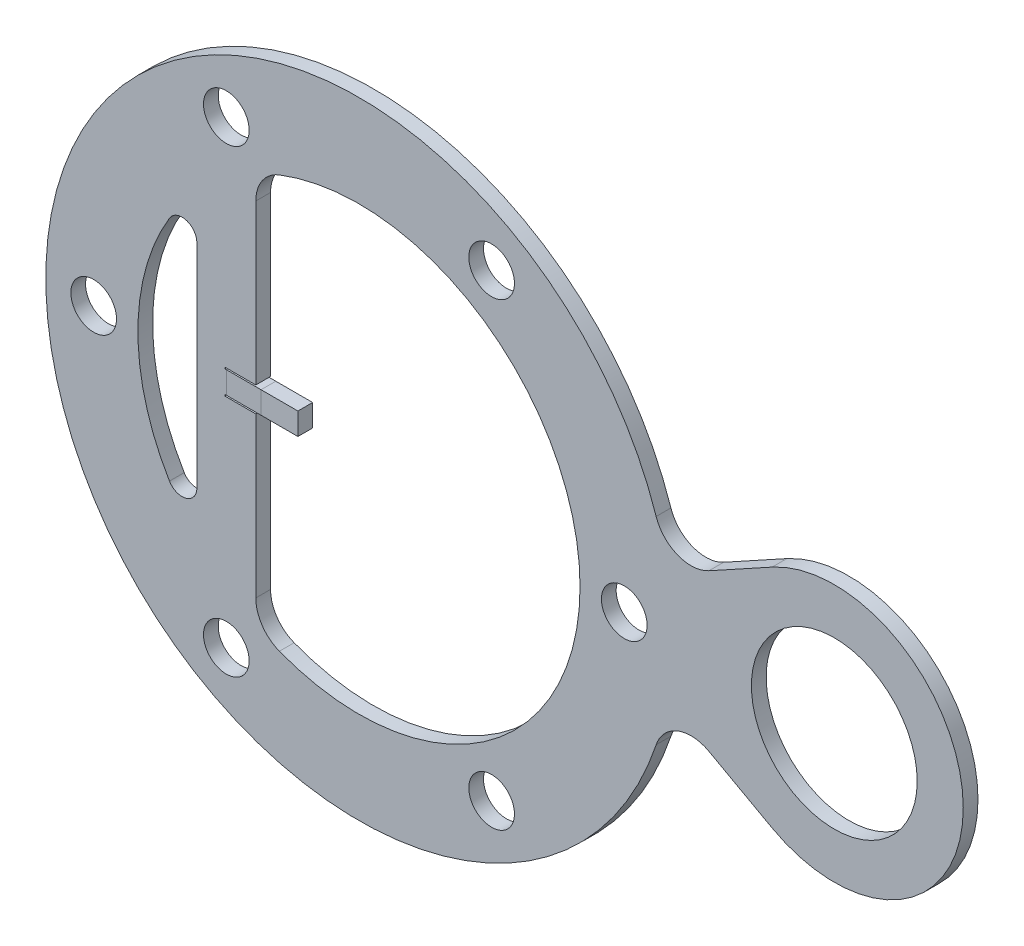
ISO-10303-21;
HEADER;
FILE_DESCRIPTION(('STEP AP214'),'2;1');
FILE_NAME('part.step','',(''),(''),'','','');
FILE_SCHEMA(('AUTOMOTIVE_DESIGN { 1 0 10303 214 1 1 1 1 }'));
ENDSEC;
DATA;
#1=APPLICATION_CONTEXT('core data for automotive mechanical design processes');
#2=APPLICATION_PROTOCOL_DEFINITION('international standard','automotive_design',2000,#1);
#3=PRODUCT_CONTEXT('',#1,'mechanical');
#4=PRODUCT('Part','Part','',(#3));
#5=PRODUCT_RELATED_PRODUCT_CATEGORY('part','',(#4));
#6=PRODUCT_DEFINITION_FORMATION('','',#4);
#7=PRODUCT_DEFINITION_CONTEXT('part definition',#1,'design');
#8=PRODUCT_DEFINITION('design','',#6,#7);
#9=PRODUCT_DEFINITION_SHAPE('','',#8);
#10=(LENGTH_UNIT() NAMED_UNIT(*) SI_UNIT(.MILLI.,.METRE.));
#11=(NAMED_UNIT(*) PLANE_ANGLE_UNIT() SI_UNIT($,.RADIAN.));
#12=(NAMED_UNIT(*) SI_UNIT($,.STERADIAN.) SOLID_ANGLE_UNIT());
#13=UNCERTAINTY_MEASURE_WITH_UNIT(LENGTH_MEASURE(1.E-05),#10,'distance_accuracy_value','');
#14=(GEOMETRIC_REPRESENTATION_CONTEXT(3) GLOBAL_UNCERTAINTY_ASSIGNED_CONTEXT((#13)) GLOBAL_UNIT_ASSIGNED_CONTEXT((#10,
#11,#12)) REPRESENTATION_CONTEXT('',''));
#15=CARTESIAN_POINT('',(0.,0.,0.));
#16=DIRECTION('',(0.,0.,1.));
#17=DIRECTION('',(1.,0.,0.));
#18=AXIS2_PLACEMENT_3D('',#15,#16,#17);
#19=CARTESIAN_POINT('',(0.,0.,0.));
#20=DIRECTION('',(0.,0.,1.));
#21=DIRECTION('',(1.,0.,0.));
#22=AXIS2_PLACEMENT_3D('',#19,#20,#21);
#23=PLANE('',#22);
#24=CARTESIAN_POINT('',(-88.5000000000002,14.4222051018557,0.));
#25=DIRECTION('',(0.,0.,1.));
#26=DIRECTION('',(1.,0.,0.));
#27=AXIS2_PLACEMENT_3D('',#24,#25,#26);
#28=CIRCLE('',#27,2.);
#29=CARTESIAN_POINT('',(-86.5000000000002,14.4222051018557,0.));
#30=VERTEX_POINT('',#29);
#31=CARTESIAN_POINT('',(-90.2142857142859,15.4523626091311,0.));
#32=VERTEX_POINT('',#31);
#33=EDGE_CURVE('E283',#30,#32,#28,.T.);
#34=ORIENTED_EDGE('',*,*,#33,.T.);
#35=CARTESIAN_POINT('',(-64.5,0.,0.));
#36=DIRECTION('',(0.,0.,1.));
#37=DIRECTION('',(1.,0.,0.));
#38=AXIS2_PLACEMENT_3D('',#35,#36,#37);
#39=CIRCLE('',#38,30.);
#40=CARTESIAN_POINT('',(-90.2142857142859,-15.4523626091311,0.));
#41=VERTEX_POINT('',#40);
#42=EDGE_CURVE('E285',#32,#41,#39,.T.);
#43=ORIENTED_EDGE('',*,*,#42,.T.);
#44=CARTESIAN_POINT('',(-88.5000000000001,-14.4222051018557,0.));
#45=DIRECTION('',(0.,0.,-1.));
#46=DIRECTION('',(-1.,0.,0.));
#47=AXIS2_PLACEMENT_3D('',#44,#45,#46);
#48=CIRCLE('',#47,2.);
#49=CARTESIAN_POINT('',(-86.5000000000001,-14.4222051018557,0.));
#50=VERTEX_POINT('',#49);
#51=EDGE_CURVE('E287',#50,#41,#48,.T.);
#52=ORIENTED_EDGE('',*,*,#51,.F.);
#53=DIRECTION('',(0.,-1.,0.));
#54=VECTOR('',#53,1.);
#55=CARTESIAN_POINT('',(-86.5000000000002,14.4222051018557,0.));
#56=LINE('',#55,#54);
#57=EDGE_CURVE('E290',#30,#50,#56,.T.);
#58=ORIENTED_EDGE('',*,*,#57,.F.);
#59=EDGE_LOOP('',(#34,#43,#52,#58));
#60=FACE_BOUND('',#59,.T.);
#61=CARTESIAN_POINT('',(-82.5000000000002,31.1769145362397,0.));
#62=DIRECTION('',(0.,0.,1.));
#63=DIRECTION('',(1.,0.,0.));
#64=AXIS2_PLACEMENT_3D('',#61,#62,#63);
#65=CIRCLE('',#64,3.1);
#66=CARTESIAN_POINT('',(-79.4000000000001,31.1769145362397,0.));
#67=VERTEX_POINT('',#66);
#68=EDGE_CURVE('E280',#67,#67,#65,.T.);
#69=ORIENTED_EDGE('',*,*,#68,.T.);
#70=EDGE_LOOP('',(#69));
#71=FACE_BOUND('',#70,.T.);
#72=CARTESIAN_POINT('',(-28.5,0.,0.));
#73=DIRECTION('',(0.,0.,1.));
#74=DIRECTION('',(1.,0.,0.));
#75=AXIS2_PLACEMENT_3D('',#72,#73,#74);
#76=CIRCLE('',#75,3.1);
#77=CARTESIAN_POINT('',(-25.4,0.,0.));
#78=VERTEX_POINT('',#77);
#79=EDGE_CURVE('E277',#78,#78,#76,.T.);
#80=ORIENTED_EDGE('',*,*,#79,.T.);
#81=EDGE_LOOP('',(#80));
#82=FACE_BOUND('',#81,.T.);
#83=CARTESIAN_POINT('',(0.,0.,0.));
#84=DIRECTION('',(0.,0.,1.));
#85=DIRECTION('',(1.,0.,0.));
#86=AXIS2_PLACEMENT_3D('',#83,#84,#85);
#87=CIRCLE('',#86,17.5);
#88=CARTESIAN_POINT('',(-8.43804173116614,-15.3313225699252,1.11022302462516E-13));
#89=VERTEX_POINT('',#88);
#90=CARTESIAN_POINT('',(-8.43804173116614,15.3313225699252,0.));
#91=VERTEX_POINT('',#90);
#92=EDGE_CURVE('E260',#89,#91,#87,.T.);
#93=ORIENTED_EDGE('',*,*,#92,.F.);
#94=DIRECTION('',(0.876075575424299,-0.482173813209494,0.));
#95=VECTOR('',#94,1.);
#96=CARTESIAN_POINT('',(-17.016509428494,-10.6099120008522,0.));
#97=LINE('',#96,#95);
#98=CARTESIAN_POINT('',(-17.016509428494,-10.6099120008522,0.));
#99=VERTEX_POINT('',#98);
#100=EDGE_CURVE('E263',#99,#89,#97,.T.);
#101=ORIENTED_EDGE('',*,*,#100,.F.);
#102=CARTESIAN_POINT('',(-19.4273784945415,-14.9902898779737,0.));
#103=DIRECTION('',(0.,0.,-1.));
#104=DIRECTION('',(-1.,0.,0.));
#105=AXIS2_PLACEMENT_3D('',#102,#103,#104);
#106=CIRCLE('',#105,5.);
#107=CARTESIAN_POINT('',(-24.1718649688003,-13.4123646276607,0.));
#108=VERTEX_POINT('',#107);
#109=EDGE_CURVE('E266',#108,#99,#106,.T.);
#110=ORIENTED_EDGE('',*,*,#109,.F.);
#111=CARTESIAN_POINT('',(-64.5,0.,0.));
#112=DIRECTION('',(0.,0.,1.));
#113=DIRECTION('',(1.,0.,0.));
#114=AXIS2_PLACEMENT_3D('',#111,#112,#113);
#115=CIRCLE('',#114,42.5);
#116=CARTESIAN_POINT('',(-24.1718649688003,13.4123646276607,0.));
#117=VERTEX_POINT('',#116);
#118=EDGE_CURVE('E269',#117,#108,#115,.T.);
#119=ORIENTED_EDGE('',*,*,#118,.F.);
#120=CARTESIAN_POINT('',(-19.4273784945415,14.9902898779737,0.));
#121=DIRECTION('',(0.,0.,-1.));
#122=DIRECTION('',(-1.,0.,0.));
#123=AXIS2_PLACEMENT_3D('',#120,#121,#122);
#124=CIRCLE('',#123,5.);
#125=CARTESIAN_POINT('',(-17.016509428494,10.6099120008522,0.));
#126=VERTEX_POINT('',#125);
#127=EDGE_CURVE('E272',#126,#117,#124,.T.);
#128=ORIENTED_EDGE('',*,*,#127,.F.);
#129=DIRECTION('',(0.876075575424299,0.482173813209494,0.));
#130=VECTOR('',#129,1.);
#131=CARTESIAN_POINT('',(-17.016509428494,10.6099120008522,0.));
#132=LINE('',#131,#130);
#133=EDGE_CURVE('E275',#126,#91,#132,.T.);
#134=ORIENTED_EDGE('',*,*,#133,.T.);
#135=EDGE_LOOP('',(#93,#101,#110,#119,#128,#134));
#136=FACE_BOUND('',#135,.T.);
#137=CARTESIAN_POINT('',(0.,0.,0.));
#138=DIRECTION('',(0.,0.,1.));
#139=DIRECTION('',(1.,0.,0.));
#140=AXIS2_PLACEMENT_3D('',#137,#138,#139);
#141=CIRCLE('',#140,11.25);
#142=CARTESIAN_POINT('',(11.25,0.,0.));
#143=VERTEX_POINT('',#142);
#144=EDGE_CURVE('E257',#143,#143,#141,.T.);
#145=ORIENTED_EDGE('',*,*,#144,.T.);
#146=EDGE_LOOP('',(#145));
#147=FACE_BOUND('',#146,.T.);
#148=CARTESIAN_POINT('',(-82.5000000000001,-31.1769145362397,0.));
#149=DIRECTION('',(0.,0.,1.));
#150=DIRECTION('',(1.,0.,0.));
#151=AXIS2_PLACEMENT_3D('',#148,#149,#150);
#152=CIRCLE('',#151,3.1);
#153=CARTESIAN_POINT('',(-79.4000000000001,-31.1769145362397,0.));
#154=VERTEX_POINT('',#153);
#155=EDGE_CURVE('E254',#154,#154,#152,.T.);
#156=ORIENTED_EDGE('',*,*,#155,.T.);
#157=EDGE_LOOP('',(#156));
#158=FACE_BOUND('',#157,.T.);
#159=CARTESIAN_POINT('',(-46.4999999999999,-31.1769145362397,0.));
#160=DIRECTION('',(0.,0.,-1.));
#161=DIRECTION('',(-1.,0.,0.));
#162=AXIS2_PLACEMENT_3D('',#159,#160,#161);
#163=CIRCLE('',#162,3.1);
#164=CARTESIAN_POINT('',(-49.5999999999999,-31.1769145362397,0.));
#165=VERTEX_POINT('',#164);
#166=EDGE_CURVE('E251',#165,#165,#163,.T.);
#167=ORIENTED_EDGE('',*,*,#166,.F.);
#168=EDGE_LOOP('',(#167));
#169=FACE_BOUND('',#168,.T.);
#170=CARTESIAN_POINT('',(-46.4999999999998,31.1769145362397,0.));
#171=DIRECTION('',(0.,0.,-1.));
#172=DIRECTION('',(-1.,0.,0.));
#173=AXIS2_PLACEMENT_3D('',#170,#171,#172);
#174=CIRCLE('',#173,3.1);
#175=CARTESIAN_POINT('',(-49.5999999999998,31.1769145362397,0.));
#176=VERTEX_POINT('',#175);
#177=EDGE_CURVE('E243',#176,#176,#174,.T.);
#178=ORIENTED_EDGE('',*,*,#177,.F.);
#179=EDGE_LOOP('',(#178));
#180=FACE_BOUND('',#179,.T.);
#181=CARTESIAN_POINT('',(-100.5,0.,0.));
#182=DIRECTION('',(0.,0.,-1.));
#183=DIRECTION('',(-1.,0.,0.));
#184=AXIS2_PLACEMENT_3D('',#181,#182,#183);
#185=CIRCLE('',#184,3.1);
#186=CARTESIAN_POINT('',(-103.6,0.,0.));
#187=VERTEX_POINT('',#186);
#188=EDGE_CURVE('E240',#187,#187,#185,.T.);
#189=ORIENTED_EDGE('',*,*,#188,.F.);
#190=EDGE_LOOP('',(#189));
#191=FACE_BOUND('',#190,.T.);
#192=DIRECTION('',(0.,1.,0.));
#193=VECTOR('',#192,1.);
#194=CARTESIAN_POINT('',(-82.5000000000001,-1.5,0.));
#195=LINE('',#194,#193);
#196=CARTESIAN_POINT('',(-82.5000000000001,-1.5,0.));
#197=VERTEX_POINT('',#196);
#198=CARTESIAN_POINT('',(-82.5000000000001,1.5,0.));
#199=VERTEX_POINT('',#198);
#200=EDGE_CURVE('E217',#197,#199,#195,.T.);
#201=ORIENTED_EDGE('',*,*,#200,.F.);
#202=DIRECTION('',(1.,0.,0.));
#203=VECTOR('',#202,1.);
#204=CARTESIAN_POINT('',(0.,-1.50000000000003,0.));
#205=LINE('',#204,#203);
#206=CARTESIAN_POINT('',(-82.7000000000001,-1.5,1.11022302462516E-13));
#207=VERTEX_POINT('',#206);
#208=EDGE_CURVE('E236',#207,#197,#205,.T.);
#209=ORIENTED_EDGE('',*,*,#208,.F.);
#210=DIRECTION('',(0.,1.,0.));
#211=VECTOR('',#210,1.);
#212=CARTESIAN_POINT('',(-82.7000000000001,0.,0.));
#213=LINE('',#212,#211);
#214=CARTESIAN_POINT('',(-82.7000000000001,-1.7,0.));
#215=VERTEX_POINT('',#214);
#216=EDGE_CURVE('E302',#215,#207,#213,.T.);
#217=ORIENTED_EDGE('',*,*,#216,.F.);
#218=DIRECTION('',(-1.,0.,0.));
#219=VECTOR('',#218,1.);
#220=CARTESIAN_POINT('',(0.,-1.70000000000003,0.));
#221=LINE('',#220,#219);
#222=CARTESIAN_POINT('',(-78.5000000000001,-1.7,0.));
#223=VERTEX_POINT('',#222);
#224=EDGE_CURVE('E305',#223,#215,#221,.T.);
#225=ORIENTED_EDGE('',*,*,#224,.F.);
#226=DIRECTION('',(0.,-1.,0.));
#227=VECTOR('',#226,1.);
#228=CARTESIAN_POINT('',(-78.5000000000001,23.3238075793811,0.));
#229=LINE('',#228,#227);
#230=CARTESIAN_POINT('',(-78.5000000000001,-23.3238075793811,0.));
#231=VERTEX_POINT('',#230);
#232=EDGE_CURVE('E300',#223,#231,#229,.T.);
#233=ORIENTED_EDGE('',*,*,#232,.T.);
#234=CARTESIAN_POINT('',(-73.5000000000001,-23.3238075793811,0.));
#235=DIRECTION('',(0.,0.,-1.));
#236=DIRECTION('',(-1.,0.,0.));
#237=AXIS2_PLACEMENT_3D('',#234,#235,#236);
#238=CIRCLE('',#237,5.00000000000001);
#239=CARTESIAN_POINT('',(-75.3000000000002,-27.9885690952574,0.));
#240=VERTEX_POINT('',#239);
#241=EDGE_CURVE('E308',#240,#231,#238,.T.);
#242=ORIENTED_EDGE('',*,*,#241,.F.);
#243=CARTESIAN_POINT('',(-64.5,0.,0.));
#244=DIRECTION('',(0.,0.,1.));
#245=DIRECTION('',(1.,0.,0.));
#246=AXIS2_PLACEMENT_3D('',#243,#244,#245);
#247=CIRCLE('',#246,30.);
#248=CARTESIAN_POINT('',(-75.3000000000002,27.9885690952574,0.));
#249=VERTEX_POINT('',#248);
#250=EDGE_CURVE('E311',#240,#249,#247,.T.);
#251=ORIENTED_EDGE('',*,*,#250,.T.);
#252=CARTESIAN_POINT('',(-73.5000000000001,23.3238075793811,0.));
#253=DIRECTION('',(0.,0.,1.));
#254=DIRECTION('',(1.,0.,0.));
#255=AXIS2_PLACEMENT_3D('',#252,#253,#254);
#256=CIRCLE('',#255,5.00000000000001);
#257=CARTESIAN_POINT('',(-78.5000000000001,23.3238075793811,0.));
#258=VERTEX_POINT('',#257);
#259=EDGE_CURVE('E299',#249,#258,#256,.T.);
#260=ORIENTED_EDGE('',*,*,#259,.T.);
#261=CARTESIAN_POINT('',(-78.5000000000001,1.7,0.));
#262=VERTEX_POINT('',#261);
#263=EDGE_CURVE('E296',#258,#262,#229,.T.);
#264=ORIENTED_EDGE('',*,*,#263,.T.);
#265=DIRECTION('',(1.,0.,0.));
#266=VECTOR('',#265,1.);
#267=CARTESIAN_POINT('',(0.,1.70000000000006,0.));
#268=LINE('',#267,#266);
#269=CARTESIAN_POINT('',(-82.7000000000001,1.7,0.));
#270=VERTEX_POINT('',#269);
#271=EDGE_CURVE('E298',#270,#262,#268,.T.);
#272=ORIENTED_EDGE('',*,*,#271,.F.);
#273=DIRECTION('',(0.,1.,0.));
#274=VECTOR('',#273,1.);
#275=CARTESIAN_POINT('',(-82.7000000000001,0.,0.));
#276=LINE('',#275,#274);
#277=CARTESIAN_POINT('',(-82.7000000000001,1.5,0.));
#278=VERTEX_POINT('',#277);
#279=EDGE_CURVE('E316',#278,#270,#276,.T.);
#280=ORIENTED_EDGE('',*,*,#279,.F.);
#281=DIRECTION('',(-1.,0.,0.));
#282=VECTOR('',#281,1.);
#283=CARTESIAN_POINT('',(0.,1.50000000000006,0.));
#284=LINE('',#283,#282);
#285=EDGE_CURVE('E293',#199,#278,#284,.T.);
#286=ORIENTED_EDGE('',*,*,#285,.F.);
#287=EDGE_LOOP('',(#201,#209,#217,#225,#233,#242,#251,#260,#264,#272,#280,#286));
#288=FACE_BOUND('',#287,.T.);
#289=ADVANCED_FACE('F28',(#60,#71,#82,#136,#147,#158,#169,#180,#191,#288),#23,.F.);
#290=CARTESIAN_POINT('',(0.,0.,2.));
#291=DIRECTION('',(0.,0.,1.));
#292=DIRECTION('',(1.,0.,0.));
#293=AXIS2_PLACEMENT_3D('',#290,#291,#292);
#294=PLANE('',#293);
#295=CARTESIAN_POINT('',(-64.5,0.,2.));
#296=DIRECTION('',(0.,0.,1.));
#297=DIRECTION('',(1.,0.,0.));
#298=AXIS2_PLACEMENT_3D('',#295,#296,#297);
#299=CIRCLE('',#298,30.);
#300=CARTESIAN_POINT('',(-90.2142857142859,15.4523626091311,2.));
#301=VERTEX_POINT('',#300);
#302=CARTESIAN_POINT('',(-90.2142857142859,-15.4523626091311,2.));
#303=VERTEX_POINT('',#302);
#304=EDGE_CURVE('E415',#301,#303,#299,.T.);
#305=ORIENTED_EDGE('',*,*,#304,.F.);
#306=CARTESIAN_POINT('',(-88.5000000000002,14.4222051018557,2.));
#307=DIRECTION('',(0.,0.,1.));
#308=DIRECTION('',(1.,0.,0.));
#309=AXIS2_PLACEMENT_3D('',#306,#307,#308);
#310=CIRCLE('',#309,2.);
#311=CARTESIAN_POINT('',(-86.5000000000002,14.4222051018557,2.));
#312=VERTEX_POINT('',#311);
#313=EDGE_CURVE('E417',#312,#301,#310,.T.);
#314=ORIENTED_EDGE('',*,*,#313,.F.);
#315=DIRECTION('',(0.,-1.,0.));
#316=VECTOR('',#315,1.);
#317=CARTESIAN_POINT('',(-86.5000000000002,14.4222051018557,2.));
#318=LINE('',#317,#316);
#319=CARTESIAN_POINT('',(-86.5000000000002,-14.4222051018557,2.));
#320=VERTEX_POINT('',#319);
#321=EDGE_CURVE('E420',#312,#320,#318,.T.);
#322=ORIENTED_EDGE('',*,*,#321,.T.);
#323=CARTESIAN_POINT('',(-88.5000000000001,-14.4222051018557,2.));
#324=DIRECTION('',(0.,0.,-1.));
#325=DIRECTION('',(-1.,0.,0.));
#326=AXIS2_PLACEMENT_3D('',#323,#324,#325);
#327=CIRCLE('',#326,2.);
#328=EDGE_CURVE('E422',#320,#303,#327,.T.);
#329=ORIENTED_EDGE('',*,*,#328,.T.);
#330=EDGE_LOOP('',(#305,#314,#322,#329));
#331=FACE_BOUND('',#330,.T.);
#332=CARTESIAN_POINT('',(-82.5000000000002,31.1769145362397,2.));
#333=DIRECTION('',(0.,0.,1.));
#334=DIRECTION('',(1.,0.,0.));
#335=AXIS2_PLACEMENT_3D('',#332,#333,#334);
#336=CIRCLE('',#335,3.1);
#337=CARTESIAN_POINT('',(-79.4000000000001,31.1769145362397,2.));
#338=VERTEX_POINT('',#337);
#339=EDGE_CURVE('E412',#338,#338,#336,.T.);
#340=ORIENTED_EDGE('',*,*,#339,.F.);
#341=EDGE_LOOP('',(#340));
#342=FACE_BOUND('',#341,.T.);
#343=CARTESIAN_POINT('',(-28.5,0.,2.));
#344=DIRECTION('',(0.,0.,1.));
#345=DIRECTION('',(1.,0.,0.));
#346=AXIS2_PLACEMENT_3D('',#343,#344,#345);
#347=CIRCLE('',#346,3.1);
#348=CARTESIAN_POINT('',(-25.4,0.,2.));
#349=VERTEX_POINT('',#348);
#350=EDGE_CURVE('E409',#349,#349,#347,.T.);
#351=ORIENTED_EDGE('',*,*,#350,.F.);
#352=EDGE_LOOP('',(#351));
#353=FACE_BOUND('',#352,.T.);
#354=CARTESIAN_POINT('',(0.,0.,2.));
#355=DIRECTION('',(0.,0.,1.));
#356=DIRECTION('',(1.,0.,0.));
#357=AXIS2_PLACEMENT_3D('',#354,#355,#356);
#358=CIRCLE('',#357,17.5);
#359=CARTESIAN_POINT('',(-8.43804173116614,-15.3313225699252,2.));
#360=VERTEX_POINT('',#359);
#361=CARTESIAN_POINT('',(-8.43804173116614,15.3313225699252,2.00000000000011));
#362=VERTEX_POINT('',#361);
#363=EDGE_CURVE('E386',#360,#362,#358,.T.);
#364=ORIENTED_EDGE('',*,*,#363,.T.);
#365=DIRECTION('',(0.876075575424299,0.482173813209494,0.));
#366=VECTOR('',#365,1.);
#367=CARTESIAN_POINT('',(-17.016509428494,10.6099120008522,2.));
#368=LINE('',#367,#366);
#369=CARTESIAN_POINT('',(-17.016509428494,10.6099120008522,2.00000000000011));
#370=VERTEX_POINT('',#369);
#371=EDGE_CURVE('E382',#370,#362,#368,.T.);
#372=ORIENTED_EDGE('',*,*,#371,.F.);
#373=CARTESIAN_POINT('',(-19.4273784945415,14.9902898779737,2.));
#374=DIRECTION('',(0.,0.,-1.));
#375=DIRECTION('',(-1.,0.,0.));
#376=AXIS2_PLACEMENT_3D('',#373,#374,#375);
#377=CIRCLE('',#376,5.);
#378=CARTESIAN_POINT('',(-24.1718649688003,13.4123646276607,2.00000000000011));
#379=VERTEX_POINT('',#378);
#380=EDGE_CURVE('E395',#370,#379,#377,.T.);
#381=ORIENTED_EDGE('',*,*,#380,.T.);
#382=CARTESIAN_POINT('',(-64.5,0.,2.));
#383=DIRECTION('',(0.,0.,1.));
#384=DIRECTION('',(1.,0.,0.));
#385=AXIS2_PLACEMENT_3D('',#382,#383,#384);
#386=CIRCLE('',#385,42.5);
#387=CARTESIAN_POINT('',(-24.1718649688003,-13.4123646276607,2.00000000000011));
#388=VERTEX_POINT('',#387);
#389=EDGE_CURVE('E403',#379,#388,#386,.T.);
#390=ORIENTED_EDGE('',*,*,#389,.T.);
#391=CARTESIAN_POINT('',(-19.4273784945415,-14.9902898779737,2.));
#392=DIRECTION('',(0.,0.,-1.));
#393=DIRECTION('',(-1.,0.,0.));
#394=AXIS2_PLACEMENT_3D('',#391,#392,#393);
#395=CIRCLE('',#394,5.);
#396=CARTESIAN_POINT('',(-17.016509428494,-10.6099120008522,2.00000000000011));
#397=VERTEX_POINT('',#396);
#398=EDGE_CURVE('E406',#388,#397,#395,.T.);
#399=ORIENTED_EDGE('',*,*,#398,.T.);
#400=DIRECTION('',(0.876075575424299,-0.482173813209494,0.));
#401=VECTOR('',#400,1.);
#402=CARTESIAN_POINT('',(-17.016509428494,-10.6099120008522,2.));
#403=LINE('',#402,#401);
#404=EDGE_CURVE('E392',#397,#360,#403,.T.);
#405=ORIENTED_EDGE('',*,*,#404,.T.);
#406=EDGE_LOOP('',(#364,#372,#381,#390,#399,#405));
#407=FACE_BOUND('',#406,.T.);
#408=CARTESIAN_POINT('',(0.,0.,2.));
#409=DIRECTION('',(0.,0.,1.));
#410=DIRECTION('',(1.,0.,0.));
#411=AXIS2_PLACEMENT_3D('',#408,#409,#410);
#412=CIRCLE('',#411,11.25);
#413=CARTESIAN_POINT('',(11.25,0.,2.));
#414=VERTEX_POINT('',#413);
#415=EDGE_CURVE('E393',#414,#414,#412,.T.);
#416=ORIENTED_EDGE('',*,*,#415,.F.);
#417=EDGE_LOOP('',(#416));
#418=FACE_BOUND('',#417,.T.);
#419=CARTESIAN_POINT('',(-82.5000000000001,-31.1769145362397,2.));
#420=DIRECTION('',(0.,0.,1.));
#421=DIRECTION('',(1.,0.,0.));
#422=AXIS2_PLACEMENT_3D('',#419,#420,#421);
#423=CIRCLE('',#422,3.1);
#424=CARTESIAN_POINT('',(-79.4000000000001,-31.1769145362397,2.));
#425=VERTEX_POINT('',#424);
#426=EDGE_CURVE('E398',#425,#425,#423,.T.);
#427=ORIENTED_EDGE('',*,*,#426,.F.);
#428=EDGE_LOOP('',(#427));
#429=FACE_BOUND('',#428,.T.);
#430=CARTESIAN_POINT('',(-46.4999999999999,-31.1769145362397,2.));
#431=DIRECTION('',(0.,0.,-1.));
#432=DIRECTION('',(-1.,0.,0.));
#433=AXIS2_PLACEMENT_3D('',#430,#431,#432);
#434=CIRCLE('',#433,3.1);
#435=CARTESIAN_POINT('',(-49.5999999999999,-31.1769145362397,2.));
#436=VERTEX_POINT('',#435);
#437=EDGE_CURVE('E697',#436,#436,#434,.T.);
#438=ORIENTED_EDGE('',*,*,#437,.T.);
#439=EDGE_LOOP('',(#438));
#440=FACE_BOUND('',#439,.T.);
#441=CARTESIAN_POINT('',(-46.4999999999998,31.1769145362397,2.));
#442=DIRECTION('',(0.,0.,-1.));
#443=DIRECTION('',(-1.,0.,0.));
#444=AXIS2_PLACEMENT_3D('',#441,#442,#443);
#445=CIRCLE('',#444,3.1);
#446=CARTESIAN_POINT('',(-49.5999999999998,31.1769145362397,2.));
#447=VERTEX_POINT('',#446);
#448=EDGE_CURVE('E694',#447,#447,#445,.T.);
#449=ORIENTED_EDGE('',*,*,#448,.T.);
#450=EDGE_LOOP('',(#449));
#451=FACE_BOUND('',#450,.T.);
#452=CARTESIAN_POINT('',(-100.5,0.,2.));
#453=DIRECTION('',(0.,0.,-1.));
#454=DIRECTION('',(-1.,0.,0.));
#455=AXIS2_PLACEMENT_3D('',#452,#453,#454);
#456=CIRCLE('',#455,3.1);
#457=CARTESIAN_POINT('',(-103.6,0.,2.));
#458=VERTEX_POINT('',#457);
#459=EDGE_CURVE('E691',#458,#458,#456,.T.);
#460=ORIENTED_EDGE('',*,*,#459,.T.);
#461=EDGE_LOOP('',(#460));
#462=FACE_BOUND('',#461,.T.);
#463=DIRECTION('',(1.,0.,0.));
#464=VECTOR('',#463,1.);
#465=CARTESIAN_POINT('',(0.,-1.50000000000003,2.));
#466=LINE('',#465,#464);
#467=CARTESIAN_POINT('',(-82.7000000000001,-1.5,2.));
#468=VERTEX_POINT('',#467);
#469=CARTESIAN_POINT('',(-82.5000000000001,-1.5,2.));
#470=VERTEX_POINT('',#469);
#471=EDGE_CURVE('E234',#468,#470,#466,.T.);
#472=ORIENTED_EDGE('',*,*,#471,.T.);
#473=DIRECTION('',(0.,1.,0.));
#474=VECTOR('',#473,1.);
#475=CARTESIAN_POINT('',(-82.5000000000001,-1.5,2.));
#476=LINE('',#475,#474);
#477=CARTESIAN_POINT('',(-82.5000000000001,1.5,2.));
#478=VERTEX_POINT('',#477);
#479=EDGE_CURVE('E206',#470,#478,#476,.T.);
#480=ORIENTED_EDGE('',*,*,#479,.T.);
#481=DIRECTION('',(-1.,0.,0.));
#482=VECTOR('',#481,1.);
#483=CARTESIAN_POINT('',(0.,1.50000000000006,2.));
#484=LINE('',#483,#482);
#485=CARTESIAN_POINT('',(-82.7000000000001,1.5,2.00000000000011));
#486=VERTEX_POINT('',#485);
#487=EDGE_CURVE('E425',#478,#486,#484,.T.);
#488=ORIENTED_EDGE('',*,*,#487,.T.);
#489=DIRECTION('',(0.,1.,0.));
#490=VECTOR('',#489,1.);
#491=CARTESIAN_POINT('',(-82.7000000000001,0.,2.));
#492=LINE('',#491,#490);
#493=CARTESIAN_POINT('',(-82.7000000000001,1.7,2.00000000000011));
#494=VERTEX_POINT('',#493);
#495=EDGE_CURVE('E45',#486,#494,#492,.T.);
#496=ORIENTED_EDGE('',*,*,#495,.T.);
#497=DIRECTION('',(1.,0.,0.));
#498=VECTOR('',#497,1.);
#499=CARTESIAN_POINT('',(0.,1.70000000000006,2.));
#500=LINE('',#499,#498);
#501=CARTESIAN_POINT('',(-78.5000000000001,1.7,2.00000000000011));
#502=VERTEX_POINT('',#501);
#503=EDGE_CURVE('E53',#494,#502,#500,.T.);
#504=ORIENTED_EDGE('',*,*,#503,.T.);
#505=DIRECTION('',(0.,-1.,0.));
#506=VECTOR('',#505,1.);
#507=CARTESIAN_POINT('',(-78.5000000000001,23.3238075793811,2.));
#508=LINE('',#507,#506);
#509=CARTESIAN_POINT('',(-78.5000000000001,23.3238075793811,2.00000000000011));
#510=VERTEX_POINT('',#509);
#511=EDGE_CURVE('E429',#510,#502,#508,.T.);
#512=ORIENTED_EDGE('',*,*,#511,.F.);
#513=CARTESIAN_POINT('',(-73.5000000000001,23.3238075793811,2.));
#514=DIRECTION('',(0.,0.,1.));
#515=DIRECTION('',(1.,0.,0.));
#516=AXIS2_PLACEMENT_3D('',#513,#514,#515);
#517=CIRCLE('',#516,5.00000000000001);
#518=CARTESIAN_POINT('',(-75.3000000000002,27.9885690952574,2.00000000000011));
#519=VERTEX_POINT('',#518);
#520=EDGE_CURVE('E431',#519,#510,#517,.T.);
#521=ORIENTED_EDGE('',*,*,#520,.F.);
#522=CARTESIAN_POINT('',(-64.5,0.,2.));
#523=DIRECTION('',(0.,0.,1.));
#524=DIRECTION('',(1.,0.,0.));
#525=AXIS2_PLACEMENT_3D('',#522,#523,#524);
#526=CIRCLE('',#525,30.);
#527=CARTESIAN_POINT('',(-75.3000000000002,-27.9885690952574,2.00000000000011));
#528=VERTEX_POINT('',#527);
#529=EDGE_CURVE('E458',#528,#519,#526,.T.);
#530=ORIENTED_EDGE('',*,*,#529,.F.);
#531=CARTESIAN_POINT('',(-73.5000000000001,-23.3238075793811,2.));
#532=DIRECTION('',(0.,0.,-1.));
#533=DIRECTION('',(-1.,0.,0.));
#534=AXIS2_PLACEMENT_3D('',#531,#532,#533);
#535=CIRCLE('',#534,5.00000000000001);
#536=CARTESIAN_POINT('',(-78.5000000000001,-23.3238075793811,2.00000000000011));
#537=VERTEX_POINT('',#536);
#538=EDGE_CURVE('E439',#528,#537,#535,.T.);
#539=ORIENTED_EDGE('',*,*,#538,.T.);
#540=CARTESIAN_POINT('',(-78.5000000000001,-1.7,2.00000000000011));
#541=VERTEX_POINT('',#540);
#542=EDGE_CURVE('E437',#541,#537,#508,.T.);
#543=ORIENTED_EDGE('',*,*,#542,.F.);
#544=DIRECTION('',(-1.,0.,0.));
#545=VECTOR('',#544,1.);
#546=CARTESIAN_POINT('',(0.,-1.70000000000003,2.));
#547=LINE('',#546,#545);
#548=CARTESIAN_POINT('',(-82.7000000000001,-1.7,2.00000000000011));
#549=VERTEX_POINT('',#548);
#550=EDGE_CURVE('E245',#541,#549,#547,.T.);
#551=ORIENTED_EDGE('',*,*,#550,.T.);
#552=DIRECTION('',(0.,1.,0.));
#553=VECTOR('',#552,1.);
#554=CARTESIAN_POINT('',(-82.7000000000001,0.,2.));
#555=LINE('',#554,#553);
#556=EDGE_CURVE('E239',#549,#468,#555,.T.);
#557=ORIENTED_EDGE('',*,*,#556,.T.);
#558=EDGE_LOOP('',(#472,#480,#488,#496,#504,#512,#521,#530,#539,#543,#551,#557));
#559=FACE_BOUND('',#558,.T.);
#560=ADVANCED_FACE('F237',(#331,#342,#353,#407,#418,#429,#440,#451,#462,#559),#294,.T.);
#561=CARTESIAN_POINT('',(-88.5000000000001,-14.4222051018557,2.));
#562=DIRECTION('',(0.,0.,-1.));
#563=DIRECTION('',(-1.,0.,0.));
#564=AXIS2_PLACEMENT_3D('',#561,#562,#563);
#565=CYLINDRICAL_SURFACE('',#564,2.);
#566=ORIENTED_EDGE('',*,*,#51,.T.);
#567=DIRECTION('',(0.,0.,-1.));
#568=VECTOR('',#567,1.);
#569=CARTESIAN_POINT('',(-90.2142857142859,-15.4523626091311,2.));
#570=LINE('',#569,#568);
#571=EDGE_CURVE('E218',#303,#41,#570,.T.);
#572=ORIENTED_EDGE('',*,*,#571,.F.);
#573=ORIENTED_EDGE('',*,*,#328,.F.);
#574=DIRECTION('',(0.,0.,-1.));
#575=VECTOR('',#574,1.);
#576=CARTESIAN_POINT('',(-86.5000000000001,-14.4222051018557,2.));
#577=LINE('',#576,#575);
#578=EDGE_CURVE('E325',#320,#50,#577,.T.);
#579=ORIENTED_EDGE('',*,*,#578,.T.);
#580=EDGE_LOOP('',(#566,#572,#573,#579));
#581=FACE_BOUND('',#580,.T.);
#582=ADVANCED_FACE('F489',(#581),#565,.F.);
#583=CARTESIAN_POINT('',(-86.5000000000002,14.4222051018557,2.));
#584=DIRECTION('',(1.,0.,0.));
#585=DIRECTION('',(0.,1.,0.));
#586=AXIS2_PLACEMENT_3D('',#583,#584,#585);
#587=PLANE('',#586);
#588=ORIENTED_EDGE('',*,*,#57,.T.);
#589=ORIENTED_EDGE('',*,*,#578,.F.);
#590=ORIENTED_EDGE('',*,*,#321,.F.);
#591=DIRECTION('',(0.,0.,-1.));
#592=VECTOR('',#591,1.);
#593=CARTESIAN_POINT('',(-86.5000000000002,14.4222051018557,2.));
#594=LINE('',#593,#592);
#595=EDGE_CURVE('E319',#312,#30,#594,.T.);
#596=ORIENTED_EDGE('',*,*,#595,.T.);
#597=EDGE_LOOP('',(#588,#589,#590,#596));
#598=FACE_BOUND('',#597,.T.);
#599=ADVANCED_FACE('F524',(#598),#587,.F.);
#600=CARTESIAN_POINT('',(-88.5000000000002,14.4222051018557,2.));
#601=DIRECTION('',(0.,0.,-1.));
#602=DIRECTION('',(-1.,0.,0.));
#603=AXIS2_PLACEMENT_3D('',#600,#601,#602);
#604=CYLINDRICAL_SURFACE('',#603,2.);
#605=ORIENTED_EDGE('',*,*,#33,.F.);
#606=ORIENTED_EDGE('',*,*,#595,.F.);
#607=ORIENTED_EDGE('',*,*,#313,.T.);
#608=DIRECTION('',(0.,0.,-1.));
#609=VECTOR('',#608,1.);
#610=CARTESIAN_POINT('',(-90.2142857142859,15.4523626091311,2.));
#611=LINE('',#610,#609);
#612=EDGE_CURVE('E322',#301,#32,#611,.T.);
#613=ORIENTED_EDGE('',*,*,#612,.T.);
#614=EDGE_LOOP('',(#605,#606,#607,#613));
#615=FACE_BOUND('',#614,.T.);
#616=ADVANCED_FACE('F521',(#615),#604,.F.);
#617=CARTESIAN_POINT('',(-64.5,0.,2.));
#618=DIRECTION('',(0.,0.,-1.));
#619=DIRECTION('',(-1.,0.,0.));
#620=AXIS2_PLACEMENT_3D('',#617,#618,#619);
#621=CYLINDRICAL_SURFACE('',#620,30.);
#622=ORIENTED_EDGE('',*,*,#42,.F.);
#623=ORIENTED_EDGE('',*,*,#612,.F.);
#624=ORIENTED_EDGE('',*,*,#304,.T.);
#625=ORIENTED_EDGE('',*,*,#571,.T.);
#626=EDGE_LOOP('',(#622,#623,#624,#625));
#627=FACE_BOUND('',#626,.T.);
#628=ADVANCED_FACE('F519',(#627),#621,.F.);
#629=CARTESIAN_POINT('',(-82.5000000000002,31.1769145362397,2.));
#630=DIRECTION('',(0.,0.,-1.));
#631=DIRECTION('',(-1.,0.,0.));
#632=AXIS2_PLACEMENT_3D('',#629,#630,#631);
#633=CYLINDRICAL_SURFACE('',#632,3.1);
#634=ORIENTED_EDGE('',*,*,#339,.T.);
#635=EDGE_LOOP('',(#634));
#636=FACE_BOUND('',#635,.T.);
#637=ORIENTED_EDGE('',*,*,#68,.F.);
#638=EDGE_LOOP('',(#637));
#639=FACE_BOUND('',#638,.T.);
#640=ADVANCED_FACE('F515',(#636,#639),#633,.F.);
#641=CARTESIAN_POINT('',(-28.5,0.,2.));
#642=DIRECTION('',(0.,0.,-1.));
#643=DIRECTION('',(-1.,0.,0.));
#644=AXIS2_PLACEMENT_3D('',#641,#642,#643);
#645=CYLINDRICAL_SURFACE('',#644,3.1);
#646=ORIENTED_EDGE('',*,*,#350,.T.);
#647=EDGE_LOOP('',(#646));
#648=FACE_BOUND('',#647,.T.);
#649=ORIENTED_EDGE('',*,*,#79,.F.);
#650=EDGE_LOOP('',(#649));
#651=FACE_BOUND('',#650,.T.);
#652=ADVANCED_FACE('F511',(#648,#651),#645,.F.);
#653=CARTESIAN_POINT('',(0.,0.,2.));
#654=DIRECTION('',(0.,0.,-1.));
#655=DIRECTION('',(-1.,0.,0.));
#656=AXIS2_PLACEMENT_3D('',#653,#654,#655);
#657=CYLINDRICAL_SURFACE('',#656,11.25);
#658=ORIENTED_EDGE('',*,*,#415,.T.);
#659=EDGE_LOOP('',(#658));
#660=FACE_BOUND('',#659,.T.);
#661=ORIENTED_EDGE('',*,*,#144,.F.);
#662=EDGE_LOOP('',(#661));
#663=FACE_BOUND('',#662,.T.);
#664=ADVANCED_FACE('F507',(#660,#663),#657,.F.);
#665=CARTESIAN_POINT('',(-82.5000000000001,-31.1769145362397,2.));
#666=DIRECTION('',(0.,0.,-1.));
#667=DIRECTION('',(-1.,0.,0.));
#668=AXIS2_PLACEMENT_3D('',#665,#666,#667);
#669=CYLINDRICAL_SURFACE('',#668,3.1);
#670=ORIENTED_EDGE('',*,*,#426,.T.);
#671=EDGE_LOOP('',(#670));
#672=FACE_BOUND('',#671,.T.);
#673=ORIENTED_EDGE('',*,*,#155,.F.);
#674=EDGE_LOOP('',(#673));
#675=FACE_BOUND('',#674,.T.);
#676=ADVANCED_FACE('F503',(#672,#675),#669,.F.);
#677=CARTESIAN_POINT('',(-46.4999999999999,-31.1769145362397,2.));
#678=DIRECTION('',(0.,0.,-1.));
#679=DIRECTION('',(-1.,0.,0.));
#680=AXIS2_PLACEMENT_3D('',#677,#678,#679);
#681=CYLINDRICAL_SURFACE('',#680,3.1);
#682=ORIENTED_EDGE('',*,*,#437,.F.);
#683=EDGE_LOOP('',(#682));
#684=FACE_BOUND('',#683,.T.);
#685=ORIENTED_EDGE('',*,*,#166,.T.);
#686=EDGE_LOOP('',(#685));
#687=FACE_BOUND('',#686,.T.);
#688=ADVANCED_FACE('F499',(#684,#687),#681,.F.);
#689=CARTESIAN_POINT('',(-46.4999999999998,31.1769145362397,2.));
#690=DIRECTION('',(0.,0.,-1.));
#691=DIRECTION('',(-1.,0.,0.));
#692=AXIS2_PLACEMENT_3D('',#689,#690,#691);
#693=CYLINDRICAL_SURFACE('',#692,3.1);
#694=ORIENTED_EDGE('',*,*,#448,.F.);
#695=EDGE_LOOP('',(#694));
#696=FACE_BOUND('',#695,.T.);
#697=ORIENTED_EDGE('',*,*,#177,.T.);
#698=EDGE_LOOP('',(#697));
#699=FACE_BOUND('',#698,.T.);
#700=ADVANCED_FACE('F496',(#696,#699),#693,.F.);
#701=CARTESIAN_POINT('',(-100.5,0.,2.));
#702=DIRECTION('',(0.,0.,-1.));
#703=DIRECTION('',(-1.,0.,0.));
#704=AXIS2_PLACEMENT_3D('',#701,#702,#703);
#705=CYLINDRICAL_SURFACE('',#704,3.1);
#706=ORIENTED_EDGE('',*,*,#459,.F.);
#707=EDGE_LOOP('',(#706));
#708=FACE_BOUND('',#707,.T.);
#709=ORIENTED_EDGE('',*,*,#188,.T.);
#710=EDGE_LOOP('',(#709));
#711=FACE_BOUND('',#710,.T.);
#712=ADVANCED_FACE('F492',(#708,#711),#705,.F.);
#713=CARTESIAN_POINT('',(-17.016509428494,-10.6099120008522,303.497927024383));
#714=DIRECTION('',(0.482173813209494,0.876075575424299,0.));
#715=DIRECTION('',(-0.876075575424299,0.482173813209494,0.));
#716=AXIS2_PLACEMENT_3D('',#713,#714,#715);
#717=PLANE('',#716);
#718=DIRECTION('',(0.,0.,-1.));
#719=VECTOR('',#718,1.);
#720=CARTESIAN_POINT('',(-17.016509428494,-10.6099120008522,303.497927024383));
#721=LINE('',#720,#719);
#722=EDGE_CURVE('E364',#397,#99,#721,.T.);
#723=ORIENTED_EDGE('',*,*,#722,.T.);
#724=ORIENTED_EDGE('',*,*,#100,.T.);
#725=DIRECTION('',(0.,0.,-1.));
#726=VECTOR('',#725,1.);
#727=CARTESIAN_POINT('',(-8.43804173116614,-15.3313225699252,303.497927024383));
#728=LINE('',#727,#726);
#729=EDGE_CURVE('E332',#360,#89,#728,.T.);
#730=ORIENTED_EDGE('',*,*,#729,.F.);
#731=ORIENTED_EDGE('',*,*,#404,.F.);
#732=EDGE_LOOP('',(#723,#724,#730,#731));
#733=FACE_BOUND('',#732,.T.);
#734=ADVANCED_FACE('F532',(#733),#717,.F.);
#735=CARTESIAN_POINT('',(-19.4273784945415,-14.9902898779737,303.497927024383));
#736=DIRECTION('',(0.,0.,-1.));
#737=DIRECTION('',(-1.,0.,0.));
#738=AXIS2_PLACEMENT_3D('',#735,#736,#737);
#739=CYLINDRICAL_SURFACE('',#738,5.);
#740=DIRECTION('',(0.,0.,-1.));
#741=VECTOR('',#740,1.);
#742=CARTESIAN_POINT('',(-24.1718649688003,-13.4123646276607,303.497927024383));
#743=LINE('',#742,#741);
#744=EDGE_CURVE('E367',#388,#108,#743,.T.);
#745=ORIENTED_EDGE('',*,*,#744,.T.);
#746=ORIENTED_EDGE('',*,*,#109,.T.);
#747=ORIENTED_EDGE('',*,*,#722,.F.);
#748=ORIENTED_EDGE('',*,*,#398,.F.);
#749=EDGE_LOOP('',(#745,#746,#747,#748));
#750=FACE_BOUND('',#749,.T.);
#751=ADVANCED_FACE('F717',(#750),#739,.F.);
#752=CARTESIAN_POINT('',(-64.5,0.,303.497927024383));
#753=DIRECTION('',(0.,0.,-1.));
#754=DIRECTION('',(-1.,0.,0.));
#755=AXIS2_PLACEMENT_3D('',#752,#753,#754);
#756=CYLINDRICAL_SURFACE('',#755,42.5);
#757=DIRECTION('',(0.,0.,-1.));
#758=VECTOR('',#757,1.);
#759=CARTESIAN_POINT('',(-24.1718649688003,13.4123646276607,303.497927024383));
#760=LINE('',#759,#758);
#761=EDGE_CURVE('E370',#379,#117,#760,.T.);
#762=ORIENTED_EDGE('',*,*,#761,.T.);
#763=ORIENTED_EDGE('',*,*,#118,.T.);
#764=ORIENTED_EDGE('',*,*,#744,.F.);
#765=ORIENTED_EDGE('',*,*,#389,.F.);
#766=EDGE_LOOP('',(#762,#763,#764,#765));
#767=FACE_BOUND('',#766,.T.);
#768=ADVANCED_FACE('F722',(#767),#756,.T.);
#769=CARTESIAN_POINT('',(-19.4273784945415,14.9902898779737,303.497927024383));
#770=DIRECTION('',(0.,0.,-1.));
#771=DIRECTION('',(-1.,0.,0.));
#772=AXIS2_PLACEMENT_3D('',#769,#770,#771);
#773=CYLINDRICAL_SURFACE('',#772,5.);
#774=DIRECTION('',(0.,0.,-1.));
#775=VECTOR('',#774,1.);
#776=CARTESIAN_POINT('',(-17.016509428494,10.6099120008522,303.497927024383));
#777=LINE('',#776,#775);
#778=EDGE_CURVE('E372',#370,#126,#777,.T.);
#779=ORIENTED_EDGE('',*,*,#778,.T.);
#780=ORIENTED_EDGE('',*,*,#127,.T.);
#781=ORIENTED_EDGE('',*,*,#761,.F.);
#782=ORIENTED_EDGE('',*,*,#380,.F.);
#783=EDGE_LOOP('',(#779,#780,#781,#782));
#784=FACE_BOUND('',#783,.T.);
#785=ADVANCED_FACE('F730',(#784),#773,.F.);
#786=CARTESIAN_POINT('',(-17.016509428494,10.6099120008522,303.497927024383));
#787=DIRECTION('',(-0.482173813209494,0.876075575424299,0.));
#788=DIRECTION('',(-0.876075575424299,-0.482173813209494,0.));
#789=AXIS2_PLACEMENT_3D('',#786,#787,#788);
#790=PLANE('',#789);
#791=ORIENTED_EDGE('',*,*,#133,.F.);
#792=ORIENTED_EDGE('',*,*,#778,.F.);
#793=ORIENTED_EDGE('',*,*,#371,.T.);
#794=DIRECTION('',(0.,0.,-1.));
#795=VECTOR('',#794,1.);
#796=CARTESIAN_POINT('',(-8.43804173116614,15.3313225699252,303.497927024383));
#797=LINE('',#796,#795);
#798=EDGE_CURVE('E32',#362,#91,#797,.T.);
#799=ORIENTED_EDGE('',*,*,#798,.T.);
#800=EDGE_LOOP('',(#791,#792,#793,#799));
#801=FACE_BOUND('',#800,.T.);
#802=ADVANCED_FACE('F380',(#801),#790,.T.);
#803=CARTESIAN_POINT('',(0.,0.,303.497927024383));
#804=DIRECTION('',(0.,0.,-1.));
#805=DIRECTION('',(-1.,0.,0.));
#806=AXIS2_PLACEMENT_3D('',#803,#804,#805);
#807=CYLINDRICAL_SURFACE('',#806,17.5);
#808=ORIENTED_EDGE('',*,*,#729,.T.);
#809=ORIENTED_EDGE('',*,*,#92,.T.);
#810=ORIENTED_EDGE('',*,*,#798,.F.);
#811=ORIENTED_EDGE('',*,*,#363,.F.);
#812=EDGE_LOOP('',(#808,#809,#810,#811));
#813=FACE_BOUND('',#812,.T.);
#814=ADVANCED_FACE('F30',(#813),#807,.T.);
#815=CARTESIAN_POINT('',(0.,-1.50000000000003,303.497927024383));
#816=DIRECTION('',(0.,1.,0.));
#817=DIRECTION('',(-1.,0.,0.));
#818=AXIS2_PLACEMENT_3D('',#815,#816,#817);
#819=PLANE('',#818);
#820=DIRECTION('',(0.,0.,-1.));
#821=VECTOR('',#820,1.);
#822=CARTESIAN_POINT('',(-82.7000000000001,-1.5,303.497927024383));
#823=LINE('',#822,#821);
#824=EDGE_CURVE('E333',#468,#207,#823,.T.);
#825=ORIENTED_EDGE('',*,*,#824,.T.);
#826=ORIENTED_EDGE('',*,*,#208,.T.);
#827=DIRECTION('',(0.,0.,-1.));
#828=VECTOR('',#827,1.);
#829=CARTESIAN_POINT('',(-82.5000000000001,-1.5,303.497927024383));
#830=LINE('',#829,#828);
#831=EDGE_CURVE('E11',#470,#197,#830,.T.);
#832=ORIENTED_EDGE('',*,*,#831,.F.);
#833=ORIENTED_EDGE('',*,*,#471,.F.);
#834=EDGE_LOOP('',(#825,#826,#832,#833));
#835=FACE_BOUND('',#834,.T.);
#836=ADVANCED_FACE('F233',(#835),#819,.F.);
#837=CARTESIAN_POINT('',(0.,1.50000000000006,303.497927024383));
#838=DIRECTION('',(0.,-1.,0.));
#839=DIRECTION('',(1.,0.,0.));
#840=AXIS2_PLACEMENT_3D('',#837,#838,#839);
#841=PLANE('',#840);
#842=ORIENTED_EDGE('',*,*,#487,.F.);
#843=DIRECTION('',(0.,0.,-1.));
#844=VECTOR('',#843,1.);
#845=CARTESIAN_POINT('',(-82.5000000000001,1.5,303.497927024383));
#846=LINE('',#845,#844);
#847=EDGE_CURVE('E37',#478,#199,#846,.T.);
#848=ORIENTED_EDGE('',*,*,#847,.T.);
#849=ORIENTED_EDGE('',*,*,#285,.T.);
#850=DIRECTION('',(0.,0.,-1.));
#851=VECTOR('',#850,1.);
#852=CARTESIAN_POINT('',(-82.7000000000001,1.5,303.497927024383));
#853=LINE('',#852,#851);
#854=EDGE_CURVE('E358',#486,#278,#853,.T.);
#855=ORIENTED_EDGE('',*,*,#854,.F.);
#856=EDGE_LOOP('',(#842,#848,#849,#855));
#857=FACE_BOUND('',#856,.T.);
#858=ADVANCED_FACE('F470',(#857),#841,.F.);
#859=CARTESIAN_POINT('',(-82.7000000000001,0.,303.497927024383));
#860=DIRECTION('',(-1.,0.,0.));
#861=DIRECTION('',(0.,-1.,0.));
#862=AXIS2_PLACEMENT_3D('',#859,#860,#861);
#863=PLANE('',#862);
#864=ORIENTED_EDGE('',*,*,#854,.T.);
#865=ORIENTED_EDGE('',*,*,#279,.T.);
#866=DIRECTION('',(0.,0.,-1.));
#867=VECTOR('',#866,1.);
#868=CARTESIAN_POINT('',(-82.7000000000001,1.7,303.497927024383));
#869=LINE('',#868,#867);
#870=EDGE_CURVE('E356',#494,#270,#869,.T.);
#871=ORIENTED_EDGE('',*,*,#870,.F.);
#872=ORIENTED_EDGE('',*,*,#495,.F.);
#873=EDGE_LOOP('',(#864,#865,#871,#872));
#874=FACE_BOUND('',#873,.T.);
#875=ADVANCED_FACE('F472',(#874),#863,.F.);
#876=CARTESIAN_POINT('',(0.,1.70000000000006,303.497927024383));
#877=DIRECTION('',(0.,1.,0.));
#878=DIRECTION('',(-1.,0.,0.));
#879=AXIS2_PLACEMENT_3D('',#876,#877,#878);
#880=PLANE('',#879);
#881=ORIENTED_EDGE('',*,*,#870,.T.);
#882=ORIENTED_EDGE('',*,*,#271,.T.);
#883=DIRECTION('',(0.,0.,-1.));
#884=VECTOR('',#883,1.);
#885=CARTESIAN_POINT('',(-78.5000000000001,1.7,303.497927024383));
#886=LINE('',#885,#884);
#887=EDGE_CURVE('E353',#502,#262,#886,.T.);
#888=ORIENTED_EDGE('',*,*,#887,.F.);
#889=ORIENTED_EDGE('',*,*,#503,.F.);
#890=EDGE_LOOP('',(#881,#882,#888,#889));
#891=FACE_BOUND('',#890,.T.);
#892=ADVANCED_FACE('F473',(#891),#880,.F.);
#893=CARTESIAN_POINT('',(-78.5000000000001,23.3238075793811,303.497927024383));
#894=DIRECTION('',(1.,0.,0.));
#895=DIRECTION('',(0.,0.,-1.));
#896=AXIS2_PLACEMENT_3D('',#893,#894,#895);
#897=PLANE('',#896);
#898=ORIENTED_EDGE('',*,*,#263,.F.);
#899=DIRECTION('',(0.,0.,-1.));
#900=VECTOR('',#899,1.);
#901=CARTESIAN_POINT('',(-78.5000000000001,23.3238075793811,303.497927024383));
#902=LINE('',#901,#900);
#903=EDGE_CURVE('E350',#510,#258,#902,.T.);
#904=ORIENTED_EDGE('',*,*,#903,.F.);
#905=ORIENTED_EDGE('',*,*,#511,.T.);
#906=ORIENTED_EDGE('',*,*,#887,.T.);
#907=EDGE_LOOP('',(#898,#904,#905,#906));
#908=FACE_BOUND('',#907,.T.);
#909=ADVANCED_FACE('F468',(#908),#897,.T.);
#910=CARTESIAN_POINT('',(-73.5000000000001,23.3238075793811,303.497927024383));
#911=DIRECTION('',(0.,0.,-1.));
#912=DIRECTION('',(-1.,0.,0.));
#913=AXIS2_PLACEMENT_3D('',#910,#911,#912);
#914=CYLINDRICAL_SURFACE('',#913,5.00000000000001);
#915=ORIENTED_EDGE('',*,*,#259,.F.);
#916=DIRECTION('',(0.,0.,-1.));
#917=VECTOR('',#916,1.);
#918=CARTESIAN_POINT('',(-75.3000000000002,27.9885690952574,303.497927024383));
#919=LINE('',#918,#917);
#920=EDGE_CURVE('E347',#519,#249,#919,.T.);
#921=ORIENTED_EDGE('',*,*,#920,.F.);
#922=ORIENTED_EDGE('',*,*,#520,.T.);
#923=ORIENTED_EDGE('',*,*,#903,.T.);
#924=EDGE_LOOP('',(#915,#921,#922,#923));
#925=FACE_BOUND('',#924,.T.);
#926=ADVANCED_FACE('F465',(#925),#914,.F.);
#927=CARTESIAN_POINT('',(-64.5,0.,303.497927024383));
#928=DIRECTION('',(0.,0.,-1.));
#929=DIRECTION('',(-1.,0.,0.));
#930=AXIS2_PLACEMENT_3D('',#927,#928,#929);
#931=CYLINDRICAL_SURFACE('',#930,30.);
#932=ORIENTED_EDGE('',*,*,#250,.F.);
#933=DIRECTION('',(0.,0.,-1.));
#934=VECTOR('',#933,1.);
#935=CARTESIAN_POINT('',(-75.3000000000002,-27.9885690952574,303.497927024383));
#936=LINE('',#935,#934);
#937=EDGE_CURVE('E344',#528,#240,#936,.T.);
#938=ORIENTED_EDGE('',*,*,#937,.F.);
#939=ORIENTED_EDGE('',*,*,#529,.T.);
#940=ORIENTED_EDGE('',*,*,#920,.T.);
#941=EDGE_LOOP('',(#932,#938,#939,#940));
#942=FACE_BOUND('',#941,.T.);
#943=ADVANCED_FACE('F457',(#942),#931,.F.);
#944=CARTESIAN_POINT('',(-73.5000000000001,-23.3238075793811,303.497927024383));
#945=DIRECTION('',(0.,0.,-1.));
#946=DIRECTION('',(-1.,0.,0.));
#947=AXIS2_PLACEMENT_3D('',#944,#945,#946);
#948=CYLINDRICAL_SURFACE('',#947,5.00000000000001);
#949=ORIENTED_EDGE('',*,*,#937,.T.);
#950=ORIENTED_EDGE('',*,*,#241,.T.);
#951=DIRECTION('',(0.,0.,-1.));
#952=VECTOR('',#951,1.);
#953=CARTESIAN_POINT('',(-78.5000000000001,-23.3238075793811,303.497927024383));
#954=LINE('',#953,#952);
#955=EDGE_CURVE('E341',#537,#231,#954,.T.);
#956=ORIENTED_EDGE('',*,*,#955,.F.);
#957=ORIENTED_EDGE('',*,*,#538,.F.);
#958=EDGE_LOOP('',(#949,#950,#956,#957));
#959=FACE_BOUND('',#958,.T.);
#960=ADVANCED_FACE('F453',(#959),#948,.F.);
#961=ORIENTED_EDGE('',*,*,#232,.F.);
#962=DIRECTION('',(0.,0.,-1.));
#963=VECTOR('',#962,1.);
#964=CARTESIAN_POINT('',(-78.5000000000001,-1.7,303.497927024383));
#965=LINE('',#964,#963);
#966=EDGE_CURVE('E338',#541,#223,#965,.T.);
#967=ORIENTED_EDGE('',*,*,#966,.F.);
#968=ORIENTED_EDGE('',*,*,#542,.T.);
#969=ORIENTED_EDGE('',*,*,#955,.T.);
#970=EDGE_LOOP('',(#961,#967,#968,#969));
#971=FACE_BOUND('',#970,.T.);
#972=ADVANCED_FACE('F448',(#971),#897,.T.);
#973=CARTESIAN_POINT('',(0.,-1.70000000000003,303.497927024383));
#974=DIRECTION('',(0.,-1.,0.));
#975=DIRECTION('',(1.,0.,0.));
#976=AXIS2_PLACEMENT_3D('',#973,#974,#975);
#977=PLANE('',#976);
#978=ORIENTED_EDGE('',*,*,#966,.T.);
#979=ORIENTED_EDGE('',*,*,#224,.T.);
#980=DIRECTION('',(0.,0.,-1.));
#981=VECTOR('',#980,1.);
#982=CARTESIAN_POINT('',(-82.7000000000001,-1.7,303.497927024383));
#983=LINE('',#982,#981);
#984=EDGE_CURVE('E335',#549,#215,#983,.T.);
#985=ORIENTED_EDGE('',*,*,#984,.F.);
#986=ORIENTED_EDGE('',*,*,#550,.F.);
#987=EDGE_LOOP('',(#978,#979,#985,#986));
#988=FACE_BOUND('',#987,.T.);
#989=ADVANCED_FACE('F445',(#988),#977,.F.);
#990=CARTESIAN_POINT('',(-82.7000000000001,0.,303.497927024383));
#991=DIRECTION('',(-1.,0.,0.));
#992=DIRECTION('',(0.,-1.,0.));
#993=AXIS2_PLACEMENT_3D('',#990,#991,#992);
#994=PLANE('',#993);
#995=ORIENTED_EDGE('',*,*,#984,.T.);
#996=ORIENTED_EDGE('',*,*,#216,.T.);
#997=ORIENTED_EDGE('',*,*,#824,.F.);
#998=ORIENTED_EDGE('',*,*,#556,.F.);
#999=EDGE_LOOP('',(#995,#996,#997,#998));
#1000=FACE_BOUND('',#999,.T.);
#1001=ADVANCED_FACE('F536',(#1000),#994,.F.);
#1002=CARTESIAN_POINT('',(-72.7876110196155,-1.5,13.6619037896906));
#1003=DIRECTION('',(0.,-1.,0.));
#1004=DIRECTION('',(0.,0.,-1.));
#1005=AXIS2_PLACEMENT_3D('',#1002,#1003,#1004);
#1006=PLANE('',#1005);
#1007=DIRECTION('',(0.,0.,-1.));
#1008=VECTOR('',#1007,1.);
#1009=CARTESIAN_POINT('',(-77.7876110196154,-1.5,13.6619037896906));
#1010=LINE('',#1009,#1008);
#1011=CARTESIAN_POINT('',(-77.7876110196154,-1.5,2.));
#1012=VERTEX_POINT('',#1011);
#1013=CARTESIAN_POINT('',(-77.7876110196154,-1.5,0.));
#1014=VERTEX_POINT('',#1013);
#1015=EDGE_CURVE('E226',#1012,#1014,#1010,.T.);
#1016=ORIENTED_EDGE('',*,*,#1015,.T.);
#1017=DIRECTION('',(-1.,0.,0.));
#1018=VECTOR('',#1017,1.);
#1019=CARTESIAN_POINT('',(-72.7876110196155,-1.5,0.));
#1020=LINE('',#1019,#1018);
#1021=CARTESIAN_POINT('',(-72.7876110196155,-1.5,0.));
#1022=VERTEX_POINT('',#1021);
#1023=EDGE_CURVE('E665',#1022,#1014,#1020,.T.);
#1024=ORIENTED_EDGE('',*,*,#1023,.F.);
#1025=DIRECTION('',(0.,0.,-1.));
#1026=VECTOR('',#1025,1.);
#1027=CARTESIAN_POINT('',(-72.7876110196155,-1.5,13.6619037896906));
#1028=LINE('',#1027,#1026);
#1029=CARTESIAN_POINT('',(-72.7876110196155,-1.5,2.));
#1030=VERTEX_POINT('',#1029);
#1031=EDGE_CURVE('E687',#1030,#1022,#1028,.T.);
#1032=ORIENTED_EDGE('',*,*,#1031,.F.);
#1033=DIRECTION('',(-1.,0.,0.));
#1034=VECTOR('',#1033,1.);
#1035=CARTESIAN_POINT('',(-72.7876110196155,-1.5,2.));
#1036=LINE('',#1035,#1034);
#1037=EDGE_CURVE('E671',#1030,#1012,#1036,.T.);
#1038=ORIENTED_EDGE('',*,*,#1037,.T.);
#1039=EDGE_LOOP('',(#1016,#1024,#1032,#1038));
#1040=FACE_BOUND('',#1039,.T.);
#1041=ADVANCED_FACE('F539',(#1040),#1006,.T.);
#1042=CARTESIAN_POINT('',(-72.7876110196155,1.5,13.6619037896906));
#1043=DIRECTION('',(1.,0.,0.));
#1044=DIRECTION('',(0.,0.,-1.));
#1045=AXIS2_PLACEMENT_3D('',#1042,#1043,#1044);
#1046=PLANE('',#1045);
#1047=ORIENTED_EDGE('',*,*,#1031,.T.);
#1048=DIRECTION('',(0.,1.,0.));
#1049=VECTOR('',#1048,1.);
#1050=CARTESIAN_POINT('',(-72.7876110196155,1.5,0.));
#1051=LINE('',#1050,#1049);
#1052=CARTESIAN_POINT('',(-72.7876110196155,1.5,0.));
#1053=VERTEX_POINT('',#1052);
#1054=EDGE_CURVE('E660',#1022,#1053,#1051,.T.);
#1055=ORIENTED_EDGE('',*,*,#1054,.T.);
#1056=DIRECTION('',(0.,0.,-1.));
#1057=VECTOR('',#1056,1.);
#1058=CARTESIAN_POINT('',(-72.7876110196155,1.5,13.6619037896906));
#1059=LINE('',#1058,#1057);
#1060=CARTESIAN_POINT('',(-72.7876110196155,1.5,2.));
#1061=VERTEX_POINT('',#1060);
#1062=EDGE_CURVE('E685',#1061,#1053,#1059,.T.);
#1063=ORIENTED_EDGE('',*,*,#1062,.F.);
#1064=DIRECTION('',(0.,-1.,0.));
#1065=VECTOR('',#1064,1.);
#1066=CARTESIAN_POINT('',(-72.7876110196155,1.5,2.));
#1067=LINE('',#1066,#1065);
#1068=EDGE_CURVE('E674',#1061,#1030,#1067,.T.);
#1069=ORIENTED_EDGE('',*,*,#1068,.T.);
#1070=EDGE_LOOP('',(#1047,#1055,#1063,#1069));
#1071=FACE_BOUND('',#1070,.T.);
#1072=ADVANCED_FACE('F583',(#1071),#1046,.T.);
#1073=CARTESIAN_POINT('',(-72.7876110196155,1.5,13.6619037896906));
#1074=DIRECTION('',(0.,-1.,0.));
#1075=DIRECTION('',(0.,0.,-1.));
#1076=AXIS2_PLACEMENT_3D('',#1073,#1074,#1075);
#1077=PLANE('',#1076);
#1078=DIRECTION('',(-1.,0.,0.));
#1079=VECTOR('',#1078,1.);
#1080=CARTESIAN_POINT('',(-72.7876110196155,1.5,0.));
#1081=LINE('',#1080,#1079);
#1082=CARTESIAN_POINT('',(-77.7876110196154,1.5,0.));
#1083=VERTEX_POINT('',#1082);
#1084=EDGE_CURVE('E654',#1053,#1083,#1081,.T.);
#1085=ORIENTED_EDGE('',*,*,#1084,.T.);
#1086=DIRECTION('',(0.,0.,-1.));
#1087=VECTOR('',#1086,1.);
#1088=CARTESIAN_POINT('',(-77.7876110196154,1.5,13.6619037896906));
#1089=LINE('',#1088,#1087);
#1090=CARTESIAN_POINT('',(-77.7876110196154,1.5,2.));
#1091=VERTEX_POINT('',#1090);
#1092=EDGE_CURVE('E682',#1091,#1083,#1089,.T.);
#1093=ORIENTED_EDGE('',*,*,#1092,.F.);
#1094=DIRECTION('',(-1.,0.,0.));
#1095=VECTOR('',#1094,1.);
#1096=CARTESIAN_POINT('',(-72.7876110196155,1.5,2.));
#1097=LINE('',#1096,#1095);
#1098=EDGE_CURVE('E677',#1061,#1091,#1097,.T.);
#1099=ORIENTED_EDGE('',*,*,#1098,.F.);
#1100=ORIENTED_EDGE('',*,*,#1062,.T.);
#1101=EDGE_LOOP('',(#1085,#1093,#1099,#1100));
#1102=FACE_BOUND('',#1101,.T.);
#1103=ADVANCED_FACE('F592',(#1102),#1077,.F.);
#1104=CARTESIAN_POINT('',(-72.7876110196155,1.5,2.));
#1105=DIRECTION('',(0.,0.,-1.));
#1106=DIRECTION('',(-1.,0.,0.));
#1107=AXIS2_PLACEMENT_3D('',#1104,#1105,#1106);
#1108=PLANE('',#1107);
#1109=ORIENTED_EDGE('',*,*,#1098,.T.);
#1110=DIRECTION('',(0.,-1.,0.));
#1111=VECTOR('',#1110,1.);
#1112=CARTESIAN_POINT('',(-77.7876110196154,-1.5,2.));
#1113=LINE('',#1112,#1111);
#1114=EDGE_CURVE('E680',#1091,#1012,#1113,.T.);
#1115=ORIENTED_EDGE('',*,*,#1114,.T.);
#1116=ORIENTED_EDGE('',*,*,#1037,.F.);
#1117=ORIENTED_EDGE('',*,*,#1068,.F.);
#1118=EDGE_LOOP('',(#1109,#1115,#1116,#1117));
#1119=FACE_BOUND('',#1118,.T.);
#1120=ADVANCED_FACE('F601',(#1119),#1108,.F.);
#1121=CARTESIAN_POINT('',(-79.7876110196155,23.3238075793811,0.));
#1122=DIRECTION('',(0.,0.,-1.));
#1123=DIRECTION('',(-1.,0.,0.));
#1124=AXIS2_PLACEMENT_3D('',#1121,#1122,#1123);
#1125=PLANE('',#1124);
#1126=DIRECTION('',(0.,-1.,0.));
#1127=VECTOR('',#1126,1.);
#1128=CARTESIAN_POINT('',(-77.7876110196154,-1.5,0.));
#1129=LINE('',#1128,#1127);
#1130=EDGE_CURVE('E651',#1083,#1014,#1129,.T.);
#1131=ORIENTED_EDGE('',*,*,#1130,.F.);
#1132=ORIENTED_EDGE('',*,*,#1084,.F.);
#1133=ORIENTED_EDGE('',*,*,#1054,.F.);
#1134=ORIENTED_EDGE('',*,*,#1023,.T.);
#1135=EDGE_LOOP('',(#1131,#1132,#1133,#1134));
#1136=FACE_BOUND('',#1135,.T.);
#1137=ADVANCED_FACE('F609',(#1136),#1125,.T.);
#1138=CARTESIAN_POINT('',(-77.7876110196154,-1.5,0.));
#1139=DIRECTION('',(0.,1.,0.));
#1140=DIRECTION('',(-1.,0.,0.));
#1141=AXIS2_PLACEMENT_3D('',#1138,#1139,#1140);
#1142=PLANE('',#1141);
#1143=DIRECTION('',(-1.,0.,0.));
#1144=VECTOR('',#1143,1.);
#1145=CARTESIAN_POINT('',(-77.7876110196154,-1.5,2.));
#1146=LINE('',#1145,#1144);
#1147=EDGE_CURVE('E210',#1012,#470,#1146,.T.);
#1148=ORIENTED_EDGE('',*,*,#1147,.T.);
#1149=ORIENTED_EDGE('',*,*,#831,.T.);
#1150=DIRECTION('',(-1.,0.,0.));
#1151=VECTOR('',#1150,1.);
#1152=CARTESIAN_POINT('',(-77.7876110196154,-1.5,0.));
#1153=LINE('',#1152,#1151);
#1154=EDGE_CURVE('E649',#1014,#197,#1153,.T.);
#1155=ORIENTED_EDGE('',*,*,#1154,.F.);
#1156=ORIENTED_EDGE('',*,*,#1015,.F.);
#1157=EDGE_LOOP('',(#1148,#1149,#1155,#1156));
#1158=FACE_BOUND('',#1157,.T.);
#1159=ADVANCED_FACE('F222',(#1158),#1142,.F.);
#1160=CARTESIAN_POINT('',(-82.5000000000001,1.5,0.));
#1161=DIRECTION('',(0.,-1.,0.));
#1162=DIRECTION('',(1.,0.,0.));
#1163=AXIS2_PLACEMENT_3D('',#1160,#1161,#1162);
#1164=PLANE('',#1163);
#1165=DIRECTION('',(1.,0.,0.));
#1166=VECTOR('',#1165,1.);
#1167=CARTESIAN_POINT('',(-82.5000000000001,1.5,2.));
#1168=LINE('',#1167,#1166);
#1169=EDGE_CURVE('E212',#478,#1091,#1168,.T.);
#1170=ORIENTED_EDGE('',*,*,#1169,.T.);
#1171=ORIENTED_EDGE('',*,*,#1092,.T.);
#1172=DIRECTION('',(1.,0.,0.));
#1173=VECTOR('',#1172,1.);
#1174=CARTESIAN_POINT('',(-82.5000000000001,1.5,0.));
#1175=LINE('',#1174,#1173);
#1176=EDGE_CURVE('E652',#199,#1083,#1175,.T.);
#1177=ORIENTED_EDGE('',*,*,#1176,.F.);
#1178=ORIENTED_EDGE('',*,*,#847,.F.);
#1179=EDGE_LOOP('',(#1170,#1171,#1177,#1178));
#1180=FACE_BOUND('',#1179,.T.);
#1181=ADVANCED_FACE('F625',(#1180),#1164,.F.);
#1182=CARTESIAN_POINT('',(-82.5000000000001,-1.5,0.));
#1183=DIRECTION('',(0.,0.,-1.));
#1184=DIRECTION('',(-1.,0.,0.));
#1185=AXIS2_PLACEMENT_3D('',#1182,#1183,#1184);
#1186=PLANE('',#1185);
#1187=ORIENTED_EDGE('',*,*,#1154,.T.);
#1188=ORIENTED_EDGE('',*,*,#200,.T.);
#1189=ORIENTED_EDGE('',*,*,#1176,.T.);
#1190=ORIENTED_EDGE('',*,*,#1130,.T.);
#1191=EDGE_LOOP('',(#1187,#1188,#1189,#1190));
#1192=FACE_BOUND('',#1191,.T.);
#1193=ADVANCED_FACE('F632',(#1192),#1186,.T.);
#1194=CARTESIAN_POINT('',(-82.5000000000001,-1.5,2.));
#1195=DIRECTION('',(0.,0.,-1.));
#1196=DIRECTION('',(-1.,0.,0.));
#1197=AXIS2_PLACEMENT_3D('',#1194,#1195,#1196);
#1198=PLANE('',#1197);
#1199=ORIENTED_EDGE('',*,*,#1147,.F.);
#1200=ORIENTED_EDGE('',*,*,#1114,.F.);
#1201=ORIENTED_EDGE('',*,*,#1169,.F.);
#1202=ORIENTED_EDGE('',*,*,#479,.F.);
#1203=EDGE_LOOP('',(#1199,#1200,#1201,#1202));
#1204=FACE_BOUND('',#1203,.T.);
#1205=ADVANCED_FACE('F208',(#1204),#1198,.F.);
#1206=CLOSED_SHELL('',(#289,#560,#582,#599,#616,#628,#640,#652,#664,#676,#688,#700,#712,#734,
#751,#768,#785,#802,#814,#836,#858,#875,#892,#909,#926,#943,#960,#972,#989,#1001,#1041,#1072,
#1103,#1120,#1137,#1159,#1181,#1193,#1205));
#1207=MANIFOLD_SOLID_BREP('B2',#1206);
#1208=ADVANCED_BREP_SHAPE_REPRESENTATION('',(#18,#1207),#14);
#1209=SHAPE_DEFINITION_REPRESENTATION(#9,#1208);
ENDSEC;
END-ISO-10303-21;
